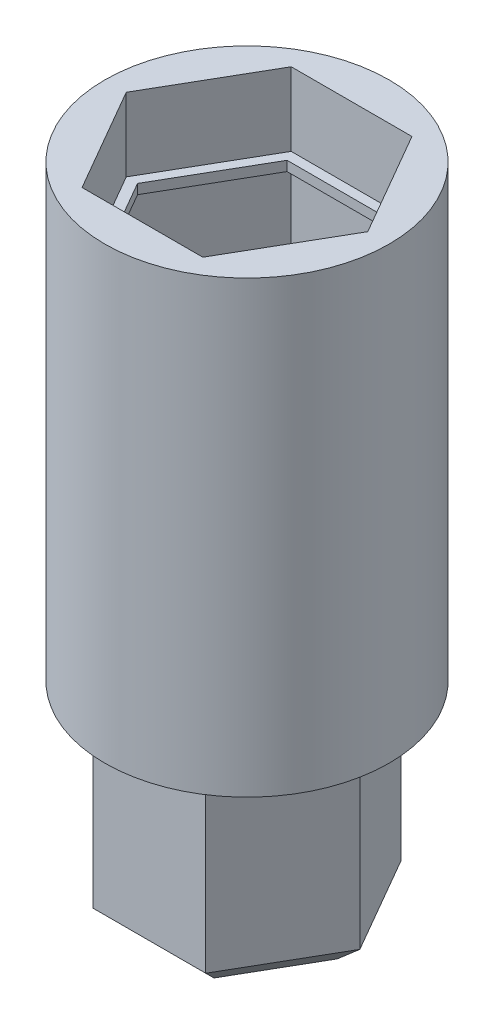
from build123d import *

# Parameters (mm, degrees)
SKETCH1_R           = 18.4785
BOSS_EXTRUDE1_DEPTH = 58.42
CUT_EXTRUDE1_DEPTH  = 9.525
CUT_EXTRUDE3_DEPTH  = 38.1
CUT_EXTRUDE5_START  = -1.27
CUT_EXTRUDE5_DEPTH  = 38.1
CHAMFER1_SIZE       = 2.54
BOSS_EXTRUDE2_DEPTH = 25.4
CHAMFER2_SIZE       = 2.54
CHAMFER3_SIZE       = 2.54


with BuildPart() as part:
    # Sketch1 → Boss-Extrude1 (new body)
    with BuildSketch(Plane(origin=(0, 0, 0), x_dir=(1, 0, 0), z_dir=(0, 1, 0))):
        with Locations(Location((0, 0, 0), (0, 0, 90))):
            Circle(SKETCH1_R)
    extrude(amount=BOSS_EXTRUDE1_DEPTH)

    # Sketch2 → Cut-Extrude1 (cut)
    with BuildSketch(Plane(origin=(0, 58.42, 0), x_dir=(1, 0, 0), z_dir=(0, 1, 0))):
        Polygon((15.691225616, 0), (7.845612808, 13.589), (-7.845612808, 13.589), (-15.691225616, 0), (-7.845612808, -13.589), (7.845612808, -13.589), align=None)
    extrude(amount=-CUT_EXTRUDE1_DEPTH, mode=Mode.SUBTRACT)

    # Sketch7 → Cut-Extrude3 (cut)
    with BuildSketch(Plane(origin=(0, 48.895, 0), x_dir=(1, 0, 0), z_dir=(0, 1, 0))):
        Polygon((14.224755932, 0), (7.112377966, 12.319), (-7.112377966, 12.319), (-14.224755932, 0), (-7.112377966, -12.319), (7.112377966, -12.319), align=None)
    extrude(amount=-CUT_EXTRUDE3_DEPTH, mode=Mode.SUBTRACT)

    # Sketch10 → Cut-Extrude5 (cut)
    with BuildSketch(Plane(origin=(0, 48.895, 0), x_dir=(1, 0, 0), z_dir=(0, 1, 0)).offset(CUT_EXTRUDE5_START)):
        Polygon((15.691225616, 0), (7.845612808, 13.589), (-7.845612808, 13.589), (-15.691225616, 0), (-7.845612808, -13.589), (7.845612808, -13.589), align=None)
    extrude(amount=-CUT_EXTRUDE5_DEPTH, mode=Mode.SUBTRACT)

    # Chamfer1
    chamfer1_edges = [part.edges().sort_by_distance(p)[0] for p in [
        (11.768419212, 9.525, 6.7945),
        (0, 9.525, 13.589),
        (-11.768419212, 9.525, 6.7945),
        (-11.768419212, 9.525, -6.7945),
        (0, 9.525, -13.589),
        (11.768419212, 9.525, -6.7945),
    ]]
    chamfer(chamfer1_edges, length=CHAMFER1_SIZE)

    # Sketch14 → Boss-Extrude2 (add)
    with BuildSketch(Plane.XZ):
        Polygon((14.664696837, 0), (7.332348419, 12.7), (-7.332348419, 12.7), (-14.664696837, 0), (-7.332348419, -12.7), (7.332348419, -12.7), align=None)
    extrude(amount=BOSS_EXTRUDE2_DEPTH)

    # Chamfer2
    chamfer2_edges = [part.edges().sort_by_distance(p)[0] for p in [
        (10.998522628, 0, -6.35),
        (10.998522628, 0, 6.35),
        (0, 0, 12.7),
        (-10.998522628, 0, 6.35),
        (-10.998522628, 0, -6.35),
        (0, 0, -12.7),
    ]]
    chamfer(chamfer2_edges, length=CHAMFER2_SIZE)

    # Chamfer3
    chamfer3_edges = [part.edges().sort_by_distance(p)[0] for p in [
        (10.998522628, -25.4, -6.35),
        (10.998522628, -25.4, 6.35),
        (0, -25.4, 12.7),
        (-10.998522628, -25.4, 6.35),
        (-10.998522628, -25.4, -6.35),
        (0, -25.4, -12.7),
    ]]
    chamfer(chamfer3_edges, length=CHAMFER3_SIZE)


solid = part.part
